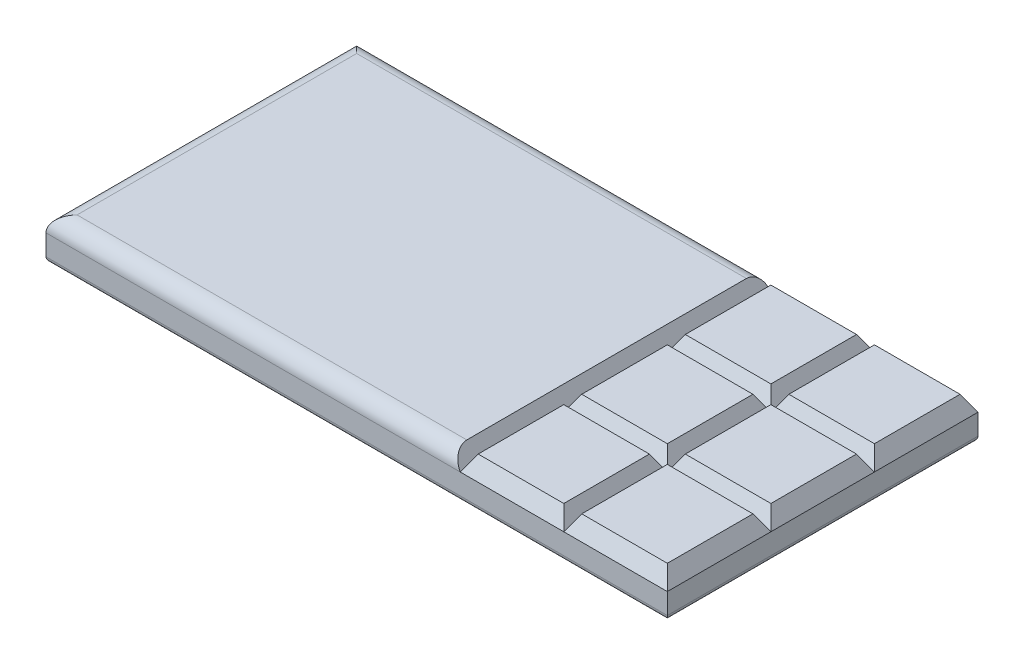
ISO-10303-21;
HEADER;
FILE_DESCRIPTION(('STEP AP214'),'2;1');
FILE_NAME('part.step','',(''),(''),'','','');
FILE_SCHEMA(('AUTOMOTIVE_DESIGN { 1 0 10303 214 1 1 1 1 }'));
ENDSEC;
DATA;
#1=APPLICATION_CONTEXT('core data for automotive mechanical design processes');
#2=APPLICATION_PROTOCOL_DEFINITION('international standard','automotive_design',2000,#1);
#3=PRODUCT_CONTEXT('',#1,'mechanical');
#4=PRODUCT('Part','Part','',(#3));
#5=PRODUCT_RELATED_PRODUCT_CATEGORY('part','',(#4));
#6=PRODUCT_DEFINITION_FORMATION('','',#4);
#7=PRODUCT_DEFINITION_CONTEXT('part definition',#1,'design');
#8=PRODUCT_DEFINITION('design','',#6,#7);
#9=PRODUCT_DEFINITION_SHAPE('','',#8);
#10=(LENGTH_UNIT() NAMED_UNIT(*) SI_UNIT(.MILLI.,.METRE.));
#11=(NAMED_UNIT(*) PLANE_ANGLE_UNIT() SI_UNIT($,.RADIAN.));
#12=(NAMED_UNIT(*) SI_UNIT($,.STERADIAN.) SOLID_ANGLE_UNIT());
#13=UNCERTAINTY_MEASURE_WITH_UNIT(LENGTH_MEASURE(1.E-05),#10,'distance_accuracy_value','');
#14=(GEOMETRIC_REPRESENTATION_CONTEXT(3) GLOBAL_UNCERTAINTY_ASSIGNED_CONTEXT((#13)) GLOBAL_UNIT_ASSIGNED_CONTEXT((#10,
#11,#12)) REPRESENTATION_CONTEXT('',''));
#15=CARTESIAN_POINT('',(0.,0.,0.));
#16=DIRECTION('',(0.,0.,1.));
#17=DIRECTION('',(1.,0.,0.));
#18=AXIS2_PLACEMENT_3D('',#15,#16,#17);
#19=CARTESIAN_POINT('',(0.,8.,0.));
#20=DIRECTION('',(0.,-1.,0.));
#21=DIRECTION('',(0.,0.,-1.));
#22=AXIS2_PLACEMENT_3D('',#19,#20,#21);
#23=PLANE('',#22);
#24=DIRECTION('',(0.,0.,-1.));
#25=VECTOR('',#24,1.);
#26=CARTESIAN_POINT('',(38.2679491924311,8.,0.));
#27=LINE('',#26,#25);
#28=CARTESIAN_POINT('',(38.2679491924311,8.,-11.7320508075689));
#29=VERTEX_POINT('',#28);
#30=CARTESIAN_POINT('',(38.2679491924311,8.,-28.2679491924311));
#31=VERTEX_POINT('',#30);
#32=EDGE_CURVE('E378',#29,#31,#27,.T.);
#33=ORIENTED_EDGE('',*,*,#32,.T.);
#34=DIRECTION('',(-1.,0.,0.));
#35=VECTOR('',#34,1.);
#36=CARTESIAN_POINT('',(0.,8.,-28.2679491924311));
#37=LINE('',#36,#35);
#38=CARTESIAN_POINT('',(21.732050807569,8.,-28.2679491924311));
#39=VERTEX_POINT('',#38);
#40=EDGE_CURVE('E491',#31,#39,#37,.T.);
#41=ORIENTED_EDGE('',*,*,#40,.T.);
#42=DIRECTION('',(0.,0.,1.));
#43=VECTOR('',#42,1.);
#44=CARTESIAN_POINT('',(21.7320508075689,8.,0.));
#45=LINE('',#44,#43);
#46=CARTESIAN_POINT('',(21.732050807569,8.,-11.7320508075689));
#47=VERTEX_POINT('',#46);
#48=EDGE_CURVE('E373',#39,#47,#45,.T.);
#49=ORIENTED_EDGE('',*,*,#48,.T.);
#50=DIRECTION('',(1.,0.,0.));
#51=VECTOR('',#50,1.);
#52=CARTESIAN_POINT('',(0.,8.,-11.7320508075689));
#53=LINE('',#52,#51);
#54=EDGE_CURVE('E478',#47,#29,#53,.T.);
#55=ORIENTED_EDGE('',*,*,#54,.T.);
#56=EDGE_LOOP('',(#33,#41,#49,#55));
#57=FACE_BOUND('',#56,.T.);
#58=ADVANCED_FACE('F35',(#57),#23,.F.);
#59=CARTESIAN_POINT('',(38.2679491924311,8.,8.26794919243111));
#60=VERTEX_POINT('',#59);
#61=CARTESIAN_POINT('',(38.2679491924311,8.,-8.26794919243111));
#62=VERTEX_POINT('',#61);
#63=EDGE_CURVE('E381',#60,#62,#27,.T.);
#64=ORIENTED_EDGE('',*,*,#63,.T.);
#65=DIRECTION('',(-1.,0.,0.));
#66=VECTOR('',#65,1.);
#67=CARTESIAN_POINT('',(0.,8.,-8.26794919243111));
#68=LINE('',#67,#66);
#69=CARTESIAN_POINT('',(21.732050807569,8.,-8.26794919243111));
#70=VERTEX_POINT('',#69);
#71=EDGE_CURVE('E469',#62,#70,#68,.T.);
#72=ORIENTED_EDGE('',*,*,#71,.T.);
#73=CARTESIAN_POINT('',(21.732050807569,8.,8.26794919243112));
#74=VERTEX_POINT('',#73);
#75=EDGE_CURVE('E376',#70,#74,#45,.T.);
#76=ORIENTED_EDGE('',*,*,#75,.T.);
#77=DIRECTION('',(1.,0.,0.));
#78=VECTOR('',#77,1.);
#79=CARTESIAN_POINT('',(0.,8.,8.26794919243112));
#80=LINE('',#79,#78);
#81=EDGE_CURVE('E418',#74,#60,#80,.T.);
#82=ORIENTED_EDGE('',*,*,#81,.T.);
#83=EDGE_LOOP('',(#64,#72,#76,#82));
#84=FACE_BOUND('',#83,.T.);
#85=ADVANCED_FACE('F527',(#84),#23,.F.);
#86=DIRECTION('',(0.,0.,-1.));
#87=VECTOR('',#86,1.);
#88=CARTESIAN_POINT('',(58.2679491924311,8.,0.));
#89=LINE('',#88,#87);
#90=CARTESIAN_POINT('',(58.2679491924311,8.,-11.7320508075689));
#91=VERTEX_POINT('',#90);
#92=CARTESIAN_POINT('',(58.2679491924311,8.,-28.2679491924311));
#93=VERTEX_POINT('',#92);
#94=EDGE_CURVE('E235',#91,#93,#89,.T.);
#95=ORIENTED_EDGE('',*,*,#94,.T.);
#96=DIRECTION('',(-1.,0.,0.));
#97=VECTOR('',#96,1.);
#98=CARTESIAN_POINT('',(0.,8.,-28.2679491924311));
#99=LINE('',#98,#97);
#100=CARTESIAN_POINT('',(41.7320508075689,8.,-28.2679491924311));
#101=VERTEX_POINT('',#100);
#102=EDGE_CURVE('E483',#93,#101,#99,.T.);
#103=ORIENTED_EDGE('',*,*,#102,.T.);
#104=DIRECTION('',(0.,0.,1.));
#105=VECTOR('',#104,1.);
#106=CARTESIAN_POINT('',(41.7320508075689,8.,0.));
#107=LINE('',#106,#105);
#108=CARTESIAN_POINT('',(41.7320508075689,8.,-11.7320508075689));
#109=VERTEX_POINT('',#108);
#110=EDGE_CURVE('E382',#101,#109,#107,.T.);
#111=ORIENTED_EDGE('',*,*,#110,.T.);
#112=DIRECTION('',(1.,0.,0.));
#113=VECTOR('',#112,1.);
#114=CARTESIAN_POINT('',(0.,8.,-11.7320508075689));
#115=LINE('',#114,#113);
#116=EDGE_CURVE('E473',#109,#91,#115,.T.);
#117=ORIENTED_EDGE('',*,*,#116,.T.);
#118=EDGE_LOOP('',(#95,#103,#111,#117));
#119=FACE_BOUND('',#118,.T.);
#120=ADVANCED_FACE('F533',(#119),#23,.F.);
#121=CARTESIAN_POINT('',(58.2679491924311,8.,8.26794919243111));
#122=VERTEX_POINT('',#121);
#123=CARTESIAN_POINT('',(58.2679491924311,8.,-8.26794919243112));
#124=VERTEX_POINT('',#123);
#125=EDGE_CURVE('E371',#122,#124,#89,.T.);
#126=ORIENTED_EDGE('',*,*,#125,.T.);
#127=DIRECTION('',(-1.,0.,0.));
#128=VECTOR('',#127,1.);
#129=CARTESIAN_POINT('',(0.,8.,-8.26794919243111));
#130=LINE('',#129,#128);
#131=CARTESIAN_POINT('',(41.7320508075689,8.,-8.26794919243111));
#132=VERTEX_POINT('',#131);
#133=EDGE_CURVE('E208',#124,#132,#130,.T.);
#134=ORIENTED_EDGE('',*,*,#133,.T.);
#135=CARTESIAN_POINT('',(41.7320508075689,8.,8.26794919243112));
#136=VERTEX_POINT('',#135);
#137=EDGE_CURVE('E386',#132,#136,#107,.T.);
#138=ORIENTED_EDGE('',*,*,#137,.T.);
#139=DIRECTION('',(1.,0.,0.));
#140=VECTOR('',#139,1.);
#141=CARTESIAN_POINT('',(0.,8.,8.26794919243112));
#142=LINE('',#141,#140);
#143=EDGE_CURVE('E459',#136,#122,#142,.T.);
#144=ORIENTED_EDGE('',*,*,#143,.T.);
#145=EDGE_LOOP('',(#126,#134,#138,#144));
#146=FACE_BOUND('',#145,.T.);
#147=ADVANCED_FACE('F555',(#146),#23,.F.);
#148=CARTESIAN_POINT('',(37.4019237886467,9.49999999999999,-30.));
#149=DIRECTION('',(-0.866025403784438,-0.5,0.));
#150=DIRECTION('',(0.5,-0.866025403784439,0.));
#151=AXIS2_PLACEMENT_3D('',#148,#149,#150);
#152=PLANE('',#151);
#153=DIRECTION('',(0.,0.,1.));
#154=VECTOR('',#153,1.);
#155=CARTESIAN_POINT('',(40.,5.00000000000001,-30.));
#156=LINE('',#155,#154);
#157=CARTESIAN_POINT('',(40.,4.99999999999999,-30.));
#158=VERTEX_POINT('',#157);
#159=CARTESIAN_POINT('',(40.,4.99999999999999,-9.99999999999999));
#160=VERTEX_POINT('',#159);
#161=EDGE_CURVE('E278',#158,#160,#156,.T.);
#162=ORIENTED_EDGE('',*,*,#161,.F.);
#163=DIRECTION('',(-0.447213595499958,0.774596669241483,0.447213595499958));
#164=VECTOR('',#163,1.);
#165=CARTESIAN_POINT('',(37.9215390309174,8.59999999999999,-27.9215390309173));
#166=LINE('',#165,#164);
#167=EDGE_CURVE('E488',#158,#31,#166,.T.);
#168=ORIENTED_EDGE('',*,*,#167,.T.);
#169=ORIENTED_EDGE('',*,*,#32,.F.);
#170=DIRECTION('',(0.447213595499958,-0.774596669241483,0.447213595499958));
#171=VECTOR('',#170,1.);
#172=CARTESIAN_POINT('',(33.9215390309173,15.5282032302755,-16.0784609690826));
#173=LINE('',#172,#171);
#174=EDGE_CURVE('E476',#29,#160,#173,.T.);
#175=ORIENTED_EDGE('',*,*,#174,.T.);
#176=EDGE_LOOP('',(#162,#168,#169,#175));
#177=FACE_BOUND('',#176,.T.);
#178=ADVANCED_FACE('F576',(#177),#152,.F.);
#179=CARTESIAN_POINT('',(40.,4.99999999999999,10.));
#180=VERTEX_POINT('',#179);
#181=EDGE_CURVE('E277',#160,#180,#156,.T.);
#182=ORIENTED_EDGE('',*,*,#181,.F.);
#183=DIRECTION('',(-0.447213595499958,0.774596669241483,0.447213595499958));
#184=VECTOR('',#183,1.);
#185=CARTESIAN_POINT('',(41.9215390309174,1.67179676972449,-11.9215390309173));
#186=LINE('',#185,#184);
#187=EDGE_CURVE('E467',#160,#62,#186,.T.);
#188=ORIENTED_EDGE('',*,*,#187,.T.);
#189=ORIENTED_EDGE('',*,*,#63,.F.);
#190=DIRECTION('',(0.447213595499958,-0.774596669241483,0.447213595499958));
#191=VECTOR('',#190,1.);
#192=CARTESIAN_POINT('',(29.9215390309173,22.456406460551,-0.0784609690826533));
#193=LINE('',#192,#191);
#194=EDGE_CURVE('E412',#60,#180,#193,.T.);
#195=ORIENTED_EDGE('',*,*,#194,.T.);
#196=EDGE_LOOP('',(#182,#188,#189,#195));
#197=FACE_BOUND('',#196,.T.);
#198=ADVANCED_FACE('F414',(#197),#152,.F.);
#199=CARTESIAN_POINT('',(40.,5.00000000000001,-30.));
#200=DIRECTION('',(0.866025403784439,-0.5,0.));
#201=DIRECTION('',(0.5,0.866025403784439,0.));
#202=AXIS2_PLACEMENT_3D('',#199,#200,#201);
#203=PLANE('',#202);
#204=ORIENTED_EDGE('',*,*,#110,.F.);
#205=DIRECTION('',(-0.447213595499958,-0.774596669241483,-0.447213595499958));
#206=VECTOR('',#205,1.);
#207=CARTESIAN_POINT('',(40.,5.00000000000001,-30.));
#208=LINE('',#207,#206);
#209=EDGE_CURVE('E486',#101,#158,#208,.T.);
#210=ORIENTED_EDGE('',*,*,#209,.T.);
#211=ORIENTED_EDGE('',*,*,#161,.T.);
#212=DIRECTION('',(0.447213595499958,0.774596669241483,-0.447213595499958));
#213=VECTOR('',#212,1.);
#214=CARTESIAN_POINT('',(44.,11.9282032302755,-14.));
#215=LINE('',#214,#213);
#216=EDGE_CURVE('E222',#160,#109,#215,.T.);
#217=ORIENTED_EDGE('',*,*,#216,.T.);
#218=EDGE_LOOP('',(#204,#210,#211,#217));
#219=FACE_BOUND('',#218,.T.);
#220=ADVANCED_FACE('F573',(#219),#203,.F.);
#221=ORIENTED_EDGE('',*,*,#137,.F.);
#222=DIRECTION('',(-0.447213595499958,-0.774596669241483,-0.447213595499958));
#223=VECTOR('',#222,1.);
#224=CARTESIAN_POINT('',(36.,-1.9282032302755,-14.));
#225=LINE('',#224,#223);
#226=EDGE_CURVE('E408',#132,#160,#225,.T.);
#227=ORIENTED_EDGE('',*,*,#226,.T.);
#228=ORIENTED_EDGE('',*,*,#181,.T.);
#229=DIRECTION('',(0.447213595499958,0.774596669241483,-0.447213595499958));
#230=VECTOR('',#229,1.);
#231=CARTESIAN_POINT('',(48.,18.856406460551,1.99999999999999));
#232=LINE('',#231,#230);
#233=EDGE_CURVE('E406',#180,#136,#232,.T.);
#234=ORIENTED_EDGE('',*,*,#233,.T.);
#235=EDGE_LOOP('',(#221,#227,#228,#234));
#236=FACE_BOUND('',#235,.T.);
#237=ADVANCED_FACE('F404',(#236),#203,.F.);
#238=CARTESIAN_POINT('',(20.,4.99999999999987,-30.));
#239=DIRECTION('',(0.866025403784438,-0.5,0.));
#240=DIRECTION('',(0.5,0.866025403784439,0.));
#241=AXIS2_PLACEMENT_3D('',#238,#239,#240);
#242=PLANE('',#241);
#243=ORIENTED_EDGE('',*,*,#48,.F.);
#244=DIRECTION('',(-0.447213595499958,-0.774596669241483,-0.447213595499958));
#245=VECTOR('',#244,1.);
#246=CARTESIAN_POINT('',(20.,4.99999999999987,-30.));
#247=LINE('',#246,#245);
#248=CARTESIAN_POINT('',(19.9999999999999,4.99999999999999,-30.));
#249=VERTEX_POINT('',#248);
#250=EDGE_CURVE('E494',#39,#249,#247,.T.);
#251=ORIENTED_EDGE('',*,*,#250,.T.);
#252=DIRECTION('',(0.,0.,1.));
#253=VECTOR('',#252,1.);
#254=CARTESIAN_POINT('',(20.,4.99999999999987,-30.));
#255=LINE('',#254,#253);
#256=CARTESIAN_POINT('',(19.9999999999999,4.99999999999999,-9.99999999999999));
#257=VERTEX_POINT('',#256);
#258=EDGE_CURVE('E255',#249,#257,#255,.T.);
#259=ORIENTED_EDGE('',*,*,#258,.T.);
#260=DIRECTION('',(0.447213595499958,0.774596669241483,-0.447213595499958));
#261=VECTOR('',#260,1.);
#262=CARTESIAN_POINT('',(24.,11.9282032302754,-13.9999999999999));
#263=LINE('',#262,#261);
#264=EDGE_CURVE('E481',#257,#47,#263,.T.);
#265=ORIENTED_EDGE('',*,*,#264,.T.);
#266=EDGE_LOOP('',(#243,#251,#259,#265));
#267=FACE_BOUND('',#266,.T.);
#268=ADVANCED_FACE('F561',(#267),#242,.F.);
#269=ORIENTED_EDGE('',*,*,#75,.F.);
#270=DIRECTION('',(-0.447213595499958,-0.774596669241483,-0.447213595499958));
#271=VECTOR('',#270,1.);
#272=CARTESIAN_POINT('',(16.,-1.92820323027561,-14.));
#273=LINE('',#272,#271);
#274=EDGE_CURVE('E288',#70,#257,#273,.T.);
#275=ORIENTED_EDGE('',*,*,#274,.T.);
#276=CARTESIAN_POINT('',(19.9999999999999,4.99999999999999,10.));
#277=VERTEX_POINT('',#276);
#278=EDGE_CURVE('E253',#257,#277,#255,.T.);
#279=ORIENTED_EDGE('',*,*,#278,.T.);
#280=DIRECTION('',(0.447213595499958,0.774596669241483,-0.447213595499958));
#281=VECTOR('',#280,1.);
#282=CARTESIAN_POINT('',(28.,18.8564064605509,2.00000000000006));
#283=LINE('',#282,#281);
#284=EDGE_CURVE('E286',#277,#74,#283,.T.);
#285=ORIENTED_EDGE('',*,*,#284,.T.);
#286=EDGE_LOOP('',(#269,#275,#279,#285));
#287=FACE_BOUND('',#286,.T.);
#288=ADVANCED_FACE('F285',(#287),#242,.F.);
#289=CARTESIAN_POINT('',(57.4019237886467,9.49999999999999,-30.));
#290=DIRECTION('',(-0.866025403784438,-0.5,0.));
#291=DIRECTION('',(0.5,-0.866025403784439,0.));
#292=AXIS2_PLACEMENT_3D('',#289,#290,#291);
#293=PLANE('',#292);
#294=DIRECTION('',(0.,0.,1.));
#295=VECTOR('',#294,1.);
#296=CARTESIAN_POINT('',(60.,5.00000000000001,-30.));
#297=LINE('',#296,#295);
#298=CARTESIAN_POINT('',(60.,4.99999999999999,-30.));
#299=VERTEX_POINT('',#298);
#300=CARTESIAN_POINT('',(60.,4.99999999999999,-9.99999999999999));
#301=VERTEX_POINT('',#300);
#302=EDGE_CURVE('E232',#299,#301,#297,.T.);
#303=ORIENTED_EDGE('',*,*,#302,.F.);
#304=DIRECTION('',(-0.447213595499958,0.774596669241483,0.447213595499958));
#305=VECTOR('',#304,1.);
#306=CARTESIAN_POINT('',(57.9215390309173,8.59999999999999,-27.9215390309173));
#307=LINE('',#306,#305);
#308=EDGE_CURVE('E236',#299,#93,#307,.T.);
#309=ORIENTED_EDGE('',*,*,#308,.T.);
#310=ORIENTED_EDGE('',*,*,#94,.F.);
#311=DIRECTION('',(0.447213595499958,-0.774596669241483,0.447213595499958));
#312=VECTOR('',#311,1.);
#313=CARTESIAN_POINT('',(53.9215390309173,15.5282032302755,-16.0784609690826));
#314=LINE('',#313,#312);
#315=EDGE_CURVE('E213',#91,#301,#314,.T.);
#316=ORIENTED_EDGE('',*,*,#315,.T.);
#317=EDGE_LOOP('',(#303,#309,#310,#316));
#318=FACE_BOUND('',#317,.T.);
#319=ADVANCED_FACE('F229',(#318),#293,.F.);
#320=CARTESIAN_POINT('',(60.,4.99999999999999,10.));
#321=VERTEX_POINT('',#320);
#322=EDGE_CURVE('E240',#301,#321,#297,.T.);
#323=ORIENTED_EDGE('',*,*,#322,.F.);
#324=DIRECTION('',(-0.447213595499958,0.774596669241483,0.447213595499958));
#325=VECTOR('',#324,1.);
#326=CARTESIAN_POINT('',(61.9215390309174,1.67179676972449,-11.9215390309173));
#327=LINE('',#326,#325);
#328=EDGE_CURVE('E202',#301,#124,#327,.T.);
#329=ORIENTED_EDGE('',*,*,#328,.T.);
#330=ORIENTED_EDGE('',*,*,#125,.F.);
#331=DIRECTION('',(0.447213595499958,-0.774596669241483,0.447213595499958));
#332=VECTOR('',#331,1.);
#333=CARTESIAN_POINT('',(49.9215390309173,22.456406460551,-0.0784609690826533));
#334=LINE('',#333,#332);
#335=EDGE_CURVE('E214',#122,#321,#334,.T.);
#336=ORIENTED_EDGE('',*,*,#335,.T.);
#337=EDGE_LOOP('',(#323,#329,#330,#336));
#338=FACE_BOUND('',#337,.T.);
#339=ADVANCED_FACE('F241',(#338),#293,.F.);
#340=DIRECTION('',(0.,0.,-1.));
#341=VECTOR('',#340,1.);
#342=CARTESIAN_POINT('',(18.267949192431,8.,0.));
#343=LINE('',#342,#341);
#344=CARTESIAN_POINT('',(18.267949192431,8.,27.));
#345=VERTEX_POINT('',#344);
#346=CARTESIAN_POINT('',(18.267949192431,8.,-27.));
#347=VERTEX_POINT('',#346);
#348=EDGE_CURVE('E326',#345,#347,#343,.T.);
#349=ORIENTED_EDGE('',*,*,#348,.T.);
#350=DIRECTION('',(-1.,0.,0.));
#351=VECTOR('',#350,1.);
#352=CARTESIAN_POINT('',(0.,8.,-27.));
#353=LINE('',#352,#351);
#354=CARTESIAN_POINT('',(-57.,8.,-27.));
#355=VERTEX_POINT('',#354);
#356=EDGE_CURVE('E319',#347,#355,#353,.T.);
#357=ORIENTED_EDGE('',*,*,#356,.T.);
#358=DIRECTION('',(0.,0.,1.));
#359=VECTOR('',#358,1.);
#360=CARTESIAN_POINT('',(-57.,8.,0.));
#361=LINE('',#360,#359);
#362=CARTESIAN_POINT('',(-57.,8.,27.));
#363=VERTEX_POINT('',#362);
#364=EDGE_CURVE('E321',#355,#363,#361,.T.);
#365=ORIENTED_EDGE('',*,*,#364,.T.);
#366=DIRECTION('',(1.,0.,0.));
#367=VECTOR('',#366,1.);
#368=CARTESIAN_POINT('',(0.,8.,27.));
#369=LINE('',#368,#367);
#370=EDGE_CURVE('E303',#363,#345,#369,.T.);
#371=ORIENTED_EDGE('',*,*,#370,.T.);
#372=EDGE_LOOP('',(#349,#357,#365,#371));
#373=FACE_BOUND('',#372,.T.);
#374=ADVANCED_FACE('F325',(#373),#23,.F.);
#375=CARTESIAN_POINT('',(21.732050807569,8.,11.7320508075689));
#376=VERTEX_POINT('',#375);
#377=CARTESIAN_POINT('',(21.732050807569,8.,28.267949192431));
#378=VERTEX_POINT('',#377);
#379=EDGE_CURVE('E374',#376,#378,#45,.T.);
#380=ORIENTED_EDGE('',*,*,#379,.T.);
#381=DIRECTION('',(1.,0.,0.));
#382=VECTOR('',#381,1.);
#383=CARTESIAN_POINT('',(0.,8.,28.267949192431));
#384=LINE('',#383,#382);
#385=CARTESIAN_POINT('',(38.2679491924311,8.,28.267949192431));
#386=VERTEX_POINT('',#385);
#387=EDGE_CURVE('E260',#378,#386,#384,.T.);
#388=ORIENTED_EDGE('',*,*,#387,.T.);
#389=CARTESIAN_POINT('',(38.2679491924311,8.,11.7320508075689));
#390=VERTEX_POINT('',#389);
#391=EDGE_CURVE('E377',#386,#390,#27,.T.);
#392=ORIENTED_EDGE('',*,*,#391,.T.);
#393=DIRECTION('',(-1.,0.,0.));
#394=VECTOR('',#393,1.);
#395=CARTESIAN_POINT('',(0.,8.,11.7320508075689));
#396=LINE('',#395,#394);
#397=EDGE_CURVE('E455',#390,#376,#396,.T.);
#398=ORIENTED_EDGE('',*,*,#397,.T.);
#399=EDGE_LOOP('',(#380,#388,#392,#398));
#400=FACE_BOUND('',#399,.T.);
#401=ADVANCED_FACE('F539',(#400),#23,.F.);
#402=CARTESIAN_POINT('',(60.,8.,30.));
#403=DIRECTION('',(-1.,0.,0.));
#404=DIRECTION('',(0.,0.,1.));
#405=AXIS2_PLACEMENT_3D('',#402,#403,#404);
#406=PLANE('',#405);
#407=DIRECTION('',(0.,-1.,0.));
#408=VECTOR('',#407,1.);
#409=CARTESIAN_POINT('',(60.,8.,30.));
#410=LINE('',#409,#408);
#411=CARTESIAN_POINT('',(60.,5.00000000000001,30.));
#412=VERTEX_POINT('',#411);
#413=CARTESIAN_POINT('',(60.,1.,30.));
#414=VERTEX_POINT('',#413);
#415=EDGE_CURVE('E392',#412,#414,#410,.T.);
#416=ORIENTED_EDGE('',*,*,#415,.T.);
#417=DIRECTION('',(0.,0.,-1.));
#418=VECTOR('',#417,1.);
#419=CARTESIAN_POINT('',(60.,1.,-30.));
#420=LINE('',#419,#418);
#421=CARTESIAN_POINT('',(60.,1.,-30.));
#422=VERTEX_POINT('',#421);
#423=EDGE_CURVE('E331',#414,#422,#420,.T.);
#424=ORIENTED_EDGE('',*,*,#423,.T.);
#425=DIRECTION('',(0.,-1.,0.));
#426=VECTOR('',#425,1.);
#427=CARTESIAN_POINT('',(60.,8.,-30.));
#428=LINE('',#427,#426);
#429=EDGE_CURVE('E250',#299,#422,#428,.T.);
#430=ORIENTED_EDGE('',*,*,#429,.F.);
#431=ORIENTED_EDGE('',*,*,#302,.T.);
#432=ORIENTED_EDGE('',*,*,#322,.T.);
#433=EDGE_CURVE('E245',#321,#412,#297,.T.);
#434=ORIENTED_EDGE('',*,*,#433,.T.);
#435=EDGE_LOOP('',(#416,#424,#430,#431,#432,#434));
#436=FACE_BOUND('',#435,.T.);
#437=ADVANCED_FACE('F248',(#436),#406,.F.);
#438=CARTESIAN_POINT('',(-60.,8.,-30.));
#439=DIRECTION('',(0.,0.,1.));
#440=DIRECTION('',(1.,0.,0.));
#441=AXIS2_PLACEMENT_3D('',#438,#439,#440);
#442=PLANE('',#441);
#443=DIRECTION('',(0.,-1.,0.));
#444=VECTOR('',#443,1.);
#445=CARTESIAN_POINT('',(-60.,8.,-30.));
#446=LINE('',#445,#444);
#447=CARTESIAN_POINT('',(-60.,5.,-30.));
#448=VERTEX_POINT('',#447);
#449=CARTESIAN_POINT('',(-60.,1.,-30.));
#450=VERTEX_POINT('',#449);
#451=EDGE_CURVE('E388',#448,#450,#446,.T.);
#452=ORIENTED_EDGE('',*,*,#451,.F.);
#453=DIRECTION('',(-1.,0.,0.));
#454=VECTOR('',#453,1.);
#455=CARTESIAN_POINT('',(-60.,5.,-30.));
#456=LINE('',#455,#454);
#457=EDGE_CURVE('E320',#448,#249,#456,.F.);
#458=ORIENTED_EDGE('',*,*,#457,.T.);
#459=DIRECTION('',(1.,0.,0.));
#460=VECTOR('',#459,1.);
#461=CARTESIAN_POINT('',(11.2954031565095,4.99999999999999,-30.));
#462=LINE('',#461,#460);
#463=EDGE_CURVE('E224',#249,#158,#462,.T.);
#464=ORIENTED_EDGE('',*,*,#463,.T.);
#465=EDGE_CURVE('E447',#158,#299,#462,.T.);
#466=ORIENTED_EDGE('',*,*,#465,.T.);
#467=ORIENTED_EDGE('',*,*,#429,.T.);
#468=DIRECTION('',(-1.,0.,0.));
#469=VECTOR('',#468,1.);
#470=CARTESIAN_POINT('',(-60.,1.,-30.));
#471=LINE('',#470,#469);
#472=EDGE_CURVE('E358',#422,#450,#471,.T.);
#473=ORIENTED_EDGE('',*,*,#472,.T.);
#474=EDGE_LOOP('',(#452,#458,#464,#466,#467,#473));
#475=FACE_BOUND('',#474,.T.);
#476=ADVANCED_FACE('F553',(#475),#442,.F.);
#477=CARTESIAN_POINT('',(-60.,8.,30.));
#478=DIRECTION('',(1.,0.,0.));
#479=DIRECTION('',(0.,0.,-1.));
#480=AXIS2_PLACEMENT_3D('',#477,#478,#479);
#481=PLANE('',#480);
#482=DIRECTION('',(0.,-1.,0.));
#483=VECTOR('',#482,1.);
#484=CARTESIAN_POINT('',(-60.,8.,30.));
#485=LINE('',#484,#483);
#486=CARTESIAN_POINT('',(-60.,5.,30.));
#487=VERTEX_POINT('',#486);
#488=CARTESIAN_POINT('',(-60.,1.,30.));
#489=VERTEX_POINT('',#488);
#490=EDGE_CURVE('E390',#487,#489,#485,.T.);
#491=ORIENTED_EDGE('',*,*,#490,.F.);
#492=DIRECTION('',(0.,0.,1.));
#493=VECTOR('',#492,1.);
#494=CARTESIAN_POINT('',(-60.,5.,30.));
#495=LINE('',#494,#493);
#496=EDGE_CURVE('E44',#487,#448,#495,.F.);
#497=ORIENTED_EDGE('',*,*,#496,.T.);
#498=ORIENTED_EDGE('',*,*,#451,.T.);
#499=DIRECTION('',(0.,0.,1.));
#500=VECTOR('',#499,1.);
#501=CARTESIAN_POINT('',(-60.,1.,30.));
#502=LINE('',#501,#500);
#503=EDGE_CURVE('E346',#450,#489,#502,.T.);
#504=ORIENTED_EDGE('',*,*,#503,.T.);
#505=EDGE_LOOP('',(#491,#497,#498,#504));
#506=FACE_BOUND('',#505,.T.);
#507=ADVANCED_FACE('F545',(#506),#481,.F.);
#508=CARTESIAN_POINT('',(-60.,8.,30.));
#509=DIRECTION('',(0.,0.,-1.));
#510=DIRECTION('',(-1.,0.,0.));
#511=AXIS2_PLACEMENT_3D('',#508,#509,#510);
#512=PLANE('',#511);
#513=DIRECTION('',(1.,0.,0.));
#514=VECTOR('',#513,1.);
#515=CARTESIAN_POINT('',(11.2954031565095,4.99999999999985,30.));
#516=LINE('',#515,#514);
#517=CARTESIAN_POINT('',(20.,4.99999999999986,30.));
#518=VERTEX_POINT('',#517);
#519=CARTESIAN_POINT('',(39.9999999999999,4.99999999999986,30.));
#520=VERTEX_POINT('',#519);
#521=EDGE_CURVE('E443',#518,#520,#516,.T.);
#522=ORIENTED_EDGE('',*,*,#521,.F.);
#523=DIRECTION('',(1.,0.,0.));
#524=VECTOR('',#523,1.);
#525=CARTESIAN_POINT('',(-60.,5.,30.));
#526=LINE('',#525,#524);
#527=EDGE_CURVE('E12',#518,#487,#526,.F.);
#528=ORIENTED_EDGE('',*,*,#527,.T.);
#529=ORIENTED_EDGE('',*,*,#490,.T.);
#530=DIRECTION('',(1.,0.,0.));
#531=VECTOR('',#530,1.);
#532=CARTESIAN_POINT('',(60.,1.,30.));
#533=LINE('',#532,#531);
#534=EDGE_CURVE('E344',#489,#414,#533,.T.);
#535=ORIENTED_EDGE('',*,*,#534,.T.);
#536=ORIENTED_EDGE('',*,*,#415,.F.);
#537=EDGE_CURVE('E335',#520,#412,#516,.T.);
#538=ORIENTED_EDGE('',*,*,#537,.F.);
#539=EDGE_LOOP('',(#522,#528,#529,#535,#536,#538));
#540=FACE_BOUND('',#539,.T.);
#541=ADVANCED_FACE('F442',(#540),#512,.F.);
#542=CARTESIAN_POINT('',(41.7320508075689,8.,11.7320508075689));
#543=VERTEX_POINT('',#542);
#544=CARTESIAN_POINT('',(41.7320508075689,8.,28.267949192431));
#545=VERTEX_POINT('',#544);
#546=EDGE_CURVE('E383',#543,#545,#107,.T.);
#547=ORIENTED_EDGE('',*,*,#546,.T.);
#548=DIRECTION('',(1.,0.,0.));
#549=VECTOR('',#548,1.);
#550=CARTESIAN_POINT('',(0.,8.,28.267949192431));
#551=LINE('',#550,#549);
#552=CARTESIAN_POINT('',(58.2679491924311,8.,28.267949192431));
#553=VERTEX_POINT('',#552);
#554=EDGE_CURVE('E496',#545,#553,#551,.T.);
#555=ORIENTED_EDGE('',*,*,#554,.T.);
#556=CARTESIAN_POINT('',(58.2679491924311,8.,11.7320508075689));
#557=VERTEX_POINT('',#556);
#558=EDGE_CURVE('E369',#553,#557,#89,.T.);
#559=ORIENTED_EDGE('',*,*,#558,.T.);
#560=DIRECTION('',(-1.,0.,0.));
#561=VECTOR('',#560,1.);
#562=CARTESIAN_POINT('',(0.,8.,11.7320508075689));
#563=LINE('',#562,#561);
#564=EDGE_CURVE('E431',#557,#543,#563,.T.);
#565=ORIENTED_EDGE('',*,*,#564,.T.);
#566=EDGE_LOOP('',(#547,#555,#559,#565));
#567=FACE_BOUND('',#566,.T.);
#568=ADVANCED_FACE('F500',(#567),#23,.F.);
#569=CARTESIAN_POINT('',(0.,0.,0.));
#570=DIRECTION('',(0.,-1.,0.));
#571=DIRECTION('',(0.,0.,-1.));
#572=AXIS2_PLACEMENT_3D('',#569,#570,#571);
#573=PLANE('',#572);
#574=DIRECTION('',(0.,0.,1.));
#575=VECTOR('',#574,1.);
#576=CARTESIAN_POINT('',(-59.,0.,-30.));
#577=LINE('',#576,#575);
#578=CARTESIAN_POINT('',(-59.,0.,29.));
#579=VERTEX_POINT('',#578);
#580=CARTESIAN_POINT('',(-59.,0.,-29.));
#581=VERTEX_POINT('',#580);
#582=EDGE_CURVE('E352',#579,#581,#577,.F.);
#583=ORIENTED_EDGE('',*,*,#582,.T.);
#584=DIRECTION('',(-1.,0.,0.));
#585=VECTOR('',#584,1.);
#586=CARTESIAN_POINT('',(60.,0.,-29.));
#587=LINE('',#586,#585);
#588=CARTESIAN_POINT('',(59.,0.,-29.));
#589=VERTEX_POINT('',#588);
#590=EDGE_CURVE('E349',#581,#589,#587,.F.);
#591=ORIENTED_EDGE('',*,*,#590,.T.);
#592=DIRECTION('',(0.,0.,-1.));
#593=VECTOR('',#592,1.);
#594=CARTESIAN_POINT('',(59.,0.,30.));
#595=LINE('',#594,#593);
#596=CARTESIAN_POINT('',(59.,0.,29.));
#597=VERTEX_POINT('',#596);
#598=EDGE_CURVE('E356',#589,#597,#595,.F.);
#599=ORIENTED_EDGE('',*,*,#598,.T.);
#600=DIRECTION('',(1.,0.,0.));
#601=VECTOR('',#600,1.);
#602=CARTESIAN_POINT('',(-60.,0.,29.));
#603=LINE('',#602,#601);
#604=EDGE_CURVE('E354',#597,#579,#603,.F.);
#605=ORIENTED_EDGE('',*,*,#604,.T.);
#606=EDGE_LOOP('',(#583,#591,#599,#605));
#607=FACE_BOUND('',#606,.T.);
#608=ADVANCED_FACE('F538',(#607),#573,.T.);
#609=ORIENTED_EDGE('',*,*,#391,.F.);
#610=DIRECTION('',(0.447213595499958,-0.774596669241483,0.447213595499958));
#611=VECTOR('',#610,1.);
#612=CARTESIAN_POINT('',(25.9215390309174,29.3846096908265,15.9215390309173));
#613=LINE('',#612,#611);
#614=EDGE_CURVE('E267',#386,#520,#613,.T.);
#615=ORIENTED_EDGE('',*,*,#614,.T.);
#616=EDGE_CURVE('E271',#180,#520,#156,.T.);
#617=ORIENTED_EDGE('',*,*,#616,.F.);
#618=DIRECTION('',(-0.447213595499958,0.774596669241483,0.447213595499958));
#619=VECTOR('',#618,1.);
#620=CARTESIAN_POINT('',(45.9215390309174,-5.25640646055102,4.07846096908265));
#621=LINE('',#620,#619);
#622=EDGE_CURVE('E430',#180,#390,#621,.T.);
#623=ORIENTED_EDGE('',*,*,#622,.T.);
#624=EDGE_LOOP('',(#609,#615,#617,#623));
#625=FACE_BOUND('',#624,.T.);
#626=ADVANCED_FACE('F436',(#625),#152,.F.);
#627=ORIENTED_EDGE('',*,*,#616,.T.);
#628=DIRECTION('',(0.447213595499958,0.774596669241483,-0.447213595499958));
#629=VECTOR('',#628,1.);
#630=CARTESIAN_POINT('',(52.,25.7846096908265,17.9999999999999));
#631=LINE('',#630,#629);
#632=EDGE_CURVE('E441',#520,#545,#631,.T.);
#633=ORIENTED_EDGE('',*,*,#632,.T.);
#634=ORIENTED_EDGE('',*,*,#546,.F.);
#635=DIRECTION('',(-0.447213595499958,-0.774596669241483,-0.447213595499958));
#636=VECTOR('',#635,1.);
#637=CARTESIAN_POINT('',(32.,-8.85640646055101,2.00000000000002));
#638=LINE('',#637,#636);
#639=EDGE_CURVE('E422',#543,#180,#638,.T.);
#640=ORIENTED_EDGE('',*,*,#639,.T.);
#641=EDGE_LOOP('',(#627,#633,#634,#640));
#642=FACE_BOUND('',#641,.T.);
#643=ADVANCED_FACE('F424',(#642),#203,.F.);
#644=CARTESIAN_POINT('',(17.4019237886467,9.49999999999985,-30.));
#645=DIRECTION('',(-0.866025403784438,-0.5,0.));
#646=DIRECTION('',(0.5,-0.866025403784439,0.));
#647=AXIS2_PLACEMENT_3D('',#644,#645,#646);
#648=PLANE('',#647);
#649=ORIENTED_EDGE('',*,*,#258,.F.);
#650=CARTESIAN_POINT('',(19.9999999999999,5.,-27.));
#651=DIRECTION('',(-0.866025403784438,-0.5,0.));
#652=DIRECTION('',(-0.5,0.866025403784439,0.));
#653=AXIS2_PLACEMENT_3D('',#650,#651,#652);
#654=ELLIPSE('',#653,3.46410161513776,3.);
#655=EDGE_CURVE('E310',#249,#347,#654,.F.);
#656=ORIENTED_EDGE('',*,*,#655,.T.);
#657=ORIENTED_EDGE('',*,*,#348,.F.);
#658=CARTESIAN_POINT('',(19.9999999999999,5.,27.));
#659=DIRECTION('',(-0.866025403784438,-0.5,0.));
#660=DIRECTION('',(0.5,-0.866025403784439,0.));
#661=AXIS2_PLACEMENT_3D('',#658,#659,#660);
#662=ELLIPSE('',#661,3.46410161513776,3.);
#663=EDGE_CURVE('E295',#345,#518,#662,.F.);
#664=ORIENTED_EDGE('',*,*,#663,.T.);
#665=EDGE_CURVE('E251',#277,#518,#255,.T.);
#666=ORIENTED_EDGE('',*,*,#665,.F.);
#667=ORIENTED_EDGE('',*,*,#278,.F.);
#668=EDGE_LOOP('',(#649,#656,#657,#664,#666,#667));
#669=FACE_BOUND('',#668,.T.);
#670=ADVANCED_FACE('F291',(#669),#648,.F.);
#671=ORIENTED_EDGE('',*,*,#665,.T.);
#672=DIRECTION('',(0.447213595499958,0.774596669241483,-0.447213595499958));
#673=VECTOR('',#672,1.);
#674=CARTESIAN_POINT('',(32.,25.7846096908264,18.));
#675=LINE('',#674,#673);
#676=EDGE_CURVE('E257',#518,#378,#675,.T.);
#677=ORIENTED_EDGE('',*,*,#676,.T.);
#678=ORIENTED_EDGE('',*,*,#379,.F.);
#679=DIRECTION('',(-0.447213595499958,-0.774596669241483,-0.447213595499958));
#680=VECTOR('',#679,1.);
#681=CARTESIAN_POINT('',(12.,-8.85640646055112,1.99999999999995));
#682=LINE('',#681,#680);
#683=EDGE_CURVE('E298',#376,#277,#682,.T.);
#684=ORIENTED_EDGE('',*,*,#683,.T.);
#685=EDGE_LOOP('',(#671,#677,#678,#684));
#686=FACE_BOUND('',#685,.T.);
#687=ADVANCED_FACE('F297',(#686),#242,.F.);
#688=ORIENTED_EDGE('',*,*,#558,.F.);
#689=DIRECTION('',(0.447213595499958,-0.774596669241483,0.447213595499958));
#690=VECTOR('',#689,1.);
#691=CARTESIAN_POINT('',(45.9215390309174,29.3846096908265,15.9215390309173));
#692=LINE('',#691,#690);
#693=EDGE_CURVE('E361',#553,#412,#692,.T.);
#694=ORIENTED_EDGE('',*,*,#693,.T.);
#695=ORIENTED_EDGE('',*,*,#433,.F.);
#696=DIRECTION('',(-0.447213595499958,0.774596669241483,0.447213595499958));
#697=VECTOR('',#696,1.);
#698=CARTESIAN_POINT('',(65.9215390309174,-5.25640646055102,4.07846096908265));
#699=LINE('',#698,#697);
#700=EDGE_CURVE('E366',#321,#557,#699,.T.);
#701=ORIENTED_EDGE('',*,*,#700,.T.);
#702=EDGE_LOOP('',(#688,#694,#695,#701));
#703=FACE_BOUND('',#702,.T.);
#704=ADVANCED_FACE('F506',(#703),#293,.F.);
#705=CARTESIAN_POINT('',(11.2954031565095,9.5,12.5980762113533));
#706=DIRECTION('',(0.,-0.5,0.866025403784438));
#707=DIRECTION('',(0.,-0.866025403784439,-0.5));
#708=AXIS2_PLACEMENT_3D('',#705,#706,#707);
#709=PLANE('',#708);
#710=ORIENTED_EDGE('',*,*,#564,.F.);
#711=ORIENTED_EDGE('',*,*,#700,.F.);
#712=DIRECTION('',(1.,0.,0.));
#713=VECTOR('',#712,1.);
#714=CARTESIAN_POINT('',(11.2954031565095,4.99999999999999,10.));
#715=LINE('',#714,#713);
#716=EDGE_CURVE('E452',#180,#321,#715,.T.);
#717=ORIENTED_EDGE('',*,*,#716,.F.);
#718=ORIENTED_EDGE('',*,*,#639,.F.);
#719=EDGE_LOOP('',(#710,#711,#717,#718));
#720=FACE_BOUND('',#719,.T.);
#721=ADVANCED_FACE('F503',(#720),#709,.F.);
#722=CARTESIAN_POINT('',(11.2954031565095,4.99999999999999,10.));
#723=DIRECTION('',(0.,-0.5,-0.866025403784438));
#724=DIRECTION('',(0.,0.866025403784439,-0.5));
#725=AXIS2_PLACEMENT_3D('',#722,#723,#724);
#726=PLANE('',#725);
#727=ORIENTED_EDGE('',*,*,#716,.T.);
#728=ORIENTED_EDGE('',*,*,#335,.F.);
#729=ORIENTED_EDGE('',*,*,#143,.F.);
#730=ORIENTED_EDGE('',*,*,#233,.F.);
#731=EDGE_LOOP('',(#727,#728,#729,#730));
#732=FACE_BOUND('',#731,.T.);
#733=ADVANCED_FACE('F519',(#732),#726,.F.);
#734=CARTESIAN_POINT('',(11.2954031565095,9.5,-7.40192378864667));
#735=DIRECTION('',(0.,-0.5,0.866025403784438));
#736=DIRECTION('',(0.,-0.866025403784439,-0.5));
#737=AXIS2_PLACEMENT_3D('',#734,#735,#736);
#738=PLANE('',#737);
#739=ORIENTED_EDGE('',*,*,#133,.F.);
#740=ORIENTED_EDGE('',*,*,#328,.F.);
#741=DIRECTION('',(1.,0.,0.));
#742=VECTOR('',#741,1.);
#743=CARTESIAN_POINT('',(11.2954031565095,4.99999999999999,-9.99999999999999));
#744=LINE('',#743,#742);
#745=EDGE_CURVE('E205',#160,#301,#744,.T.);
#746=ORIENTED_EDGE('',*,*,#745,.F.);
#747=ORIENTED_EDGE('',*,*,#226,.F.);
#748=EDGE_LOOP('',(#739,#740,#746,#747));
#749=FACE_BOUND('',#748,.T.);
#750=ADVANCED_FACE('F204',(#749),#738,.F.);
#751=CARTESIAN_POINT('',(11.2954031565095,4.99999999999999,-9.99999999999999));
#752=DIRECTION('',(0.,-0.5,-0.866025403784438));
#753=DIRECTION('',(0.,0.866025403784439,-0.5));
#754=AXIS2_PLACEMENT_3D('',#751,#752,#753);
#755=PLANE('',#754);
#756=ORIENTED_EDGE('',*,*,#745,.T.);
#757=ORIENTED_EDGE('',*,*,#315,.F.);
#758=ORIENTED_EDGE('',*,*,#116,.F.);
#759=ORIENTED_EDGE('',*,*,#216,.F.);
#760=EDGE_LOOP('',(#756,#757,#758,#759));
#761=FACE_BOUND('',#760,.T.);
#762=ADVANCED_FACE('F219',(#761),#755,.F.);
#763=CARTESIAN_POINT('',(11.2954031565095,9.5,-27.4019237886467));
#764=DIRECTION('',(0.,-0.5,0.866025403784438));
#765=DIRECTION('',(0.,-0.866025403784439,-0.5));
#766=AXIS2_PLACEMENT_3D('',#763,#764,#765);
#767=PLANE('',#766);
#768=ORIENTED_EDGE('',*,*,#102,.F.);
#769=ORIENTED_EDGE('',*,*,#308,.F.);
#770=ORIENTED_EDGE('',*,*,#465,.F.);
#771=ORIENTED_EDGE('',*,*,#209,.F.);
#772=EDGE_LOOP('',(#768,#769,#770,#771));
#773=FACE_BOUND('',#772,.T.);
#774=ADVANCED_FACE('F510',(#773),#767,.F.);
#775=CARTESIAN_POINT('',(11.2954031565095,4.99999999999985,30.));
#776=DIRECTION('',(0.,-0.5,-0.866025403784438));
#777=DIRECTION('',(0.,0.866025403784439,-0.5));
#778=AXIS2_PLACEMENT_3D('',#775,#776,#777);
#779=PLANE('',#778);
#780=ORIENTED_EDGE('',*,*,#537,.T.);
#781=ORIENTED_EDGE('',*,*,#693,.F.);
#782=ORIENTED_EDGE('',*,*,#554,.F.);
#783=ORIENTED_EDGE('',*,*,#632,.F.);
#784=EDGE_LOOP('',(#780,#781,#782,#783));
#785=FACE_BOUND('',#784,.T.);
#786=ADVANCED_FACE('F507',(#785),#779,.F.);
#787=EDGE_CURVE('E450',#277,#180,#715,.T.);
#788=ORIENTED_EDGE('',*,*,#787,.T.);
#789=ORIENTED_EDGE('',*,*,#194,.F.);
#790=ORIENTED_EDGE('',*,*,#81,.F.);
#791=ORIENTED_EDGE('',*,*,#284,.F.);
#792=EDGE_LOOP('',(#788,#789,#790,#791));
#793=FACE_BOUND('',#792,.T.);
#794=ADVANCED_FACE('F509',(#793),#726,.F.);
#795=ORIENTED_EDGE('',*,*,#397,.F.);
#796=ORIENTED_EDGE('',*,*,#622,.F.);
#797=ORIENTED_EDGE('',*,*,#787,.F.);
#798=ORIENTED_EDGE('',*,*,#683,.F.);
#799=EDGE_LOOP('',(#795,#796,#797,#798));
#800=FACE_BOUND('',#799,.T.);
#801=ADVANCED_FACE('F517',(#800),#709,.F.);
#802=EDGE_CURVE('E223',#257,#160,#744,.T.);
#803=ORIENTED_EDGE('',*,*,#802,.T.);
#804=ORIENTED_EDGE('',*,*,#174,.F.);
#805=ORIENTED_EDGE('',*,*,#54,.F.);
#806=ORIENTED_EDGE('',*,*,#264,.F.);
#807=EDGE_LOOP('',(#803,#804,#805,#806));
#808=FACE_BOUND('',#807,.T.);
#809=ADVANCED_FACE('F564',(#808),#755,.F.);
#810=ORIENTED_EDGE('',*,*,#71,.F.);
#811=ORIENTED_EDGE('',*,*,#187,.F.);
#812=ORIENTED_EDGE('',*,*,#802,.F.);
#813=ORIENTED_EDGE('',*,*,#274,.F.);
#814=EDGE_LOOP('',(#810,#811,#812,#813));
#815=FACE_BOUND('',#814,.T.);
#816=ADVANCED_FACE('F567',(#815),#738,.F.);
#817=ORIENTED_EDGE('',*,*,#40,.F.);
#818=ORIENTED_EDGE('',*,*,#167,.F.);
#819=ORIENTED_EDGE('',*,*,#463,.F.);
#820=ORIENTED_EDGE('',*,*,#250,.F.);
#821=EDGE_LOOP('',(#817,#818,#819,#820));
#822=FACE_BOUND('',#821,.T.);
#823=ADVANCED_FACE('F522',(#822),#767,.F.);
#824=ORIENTED_EDGE('',*,*,#521,.T.);
#825=ORIENTED_EDGE('',*,*,#614,.F.);
#826=ORIENTED_EDGE('',*,*,#387,.F.);
#827=ORIENTED_EDGE('',*,*,#676,.F.);
#828=EDGE_LOOP('',(#824,#825,#826,#827));
#829=FACE_BOUND('',#828,.T.);
#830=ADVANCED_FACE('F512',(#829),#779,.F.);
#831=CARTESIAN_POINT('',(-60.,1.,29.));
#832=DIRECTION('',(-1.,0.,0.));
#833=DIRECTION('',(0.,0.,1.));
#834=AXIS2_PLACEMENT_3D('',#831,#832,#833);
#835=CYLINDRICAL_SURFACE('',#834,1.);
#836=CARTESIAN_POINT('',(-59.,1.,29.));
#837=DIRECTION('',(-0.707106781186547,0.,-0.707106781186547));
#838=DIRECTION('',(-0.707106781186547,0.,0.707106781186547));
#839=AXIS2_PLACEMENT_3D('',#836,#837,#838);
#840=ELLIPSE('',#839,1.41421356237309,1.);
#841=EDGE_CURVE('E336',#579,#489,#840,.T.);
#842=ORIENTED_EDGE('',*,*,#841,.F.);
#843=ORIENTED_EDGE('',*,*,#604,.F.);
#844=CARTESIAN_POINT('',(59.,1.,29.));
#845=DIRECTION('',(-0.707106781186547,0.,0.707106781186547));
#846=DIRECTION('',(0.707106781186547,0.,0.707106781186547));
#847=AXIS2_PLACEMENT_3D('',#844,#845,#846);
#848=ELLIPSE('',#847,1.41421356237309,1.);
#849=EDGE_CURVE('E332',#414,#597,#848,.F.);
#850=ORIENTED_EDGE('',*,*,#849,.F.);
#851=ORIENTED_EDGE('',*,*,#534,.F.);
#852=EDGE_LOOP('',(#842,#843,#850,#851));
#853=FACE_BOUND('',#852,.T.);
#854=ADVANCED_FACE('F525',(#853),#835,.T.);
#855=CARTESIAN_POINT('',(59.,1.,30.));
#856=DIRECTION('',(0.,0.,1.));
#857=DIRECTION('',(1.,0.,0.));
#858=AXIS2_PLACEMENT_3D('',#855,#856,#857);
#859=CYLINDRICAL_SURFACE('',#858,1.);
#860=ORIENTED_EDGE('',*,*,#849,.T.);
#861=ORIENTED_EDGE('',*,*,#598,.F.);
#862=CARTESIAN_POINT('',(59.,1.,-29.));
#863=DIRECTION('',(0.707106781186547,0.,0.707106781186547));
#864=DIRECTION('',(-0.707106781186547,0.,0.707106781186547));
#865=AXIS2_PLACEMENT_3D('',#862,#863,#864);
#866=ELLIPSE('',#865,1.41421356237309,1.);
#867=EDGE_CURVE('E339',#422,#589,#866,.F.);
#868=ORIENTED_EDGE('',*,*,#867,.F.);
#869=ORIENTED_EDGE('',*,*,#423,.F.);
#870=EDGE_LOOP('',(#860,#861,#868,#869));
#871=FACE_BOUND('',#870,.T.);
#872=ADVANCED_FACE('F600',(#871),#859,.T.);
#873=CARTESIAN_POINT('',(-59.,1.,30.));
#874=DIRECTION('',(0.,0.,-1.));
#875=DIRECTION('',(-1.,0.,0.));
#876=AXIS2_PLACEMENT_3D('',#873,#874,#875);
#877=CYLINDRICAL_SURFACE('',#876,1.);
#878=ORIENTED_EDGE('',*,*,#841,.T.);
#879=ORIENTED_EDGE('',*,*,#503,.F.);
#880=CARTESIAN_POINT('',(-59.,1.,-29.));
#881=DIRECTION('',(0.707106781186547,0.,-0.707106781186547));
#882=DIRECTION('',(-0.707106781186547,0.,-0.707106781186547));
#883=AXIS2_PLACEMENT_3D('',#880,#881,#882);
#884=ELLIPSE('',#883,1.41421356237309,1.);
#885=EDGE_CURVE('E306',#581,#450,#884,.T.);
#886=ORIENTED_EDGE('',*,*,#885,.F.);
#887=ORIENTED_EDGE('',*,*,#582,.F.);
#888=EDGE_LOOP('',(#878,#879,#886,#887));
#889=FACE_BOUND('',#888,.T.);
#890=ADVANCED_FACE('F591',(#889),#877,.T.);
#891=CARTESIAN_POINT('',(-60.,1.,-29.));
#892=DIRECTION('',(1.,0.,0.));
#893=DIRECTION('',(0.,0.,-1.));
#894=AXIS2_PLACEMENT_3D('',#891,#892,#893);
#895=CYLINDRICAL_SURFACE('',#894,1.);
#896=ORIENTED_EDGE('',*,*,#867,.T.);
#897=ORIENTED_EDGE('',*,*,#590,.F.);
#898=ORIENTED_EDGE('',*,*,#885,.T.);
#899=ORIENTED_EDGE('',*,*,#472,.F.);
#900=EDGE_LOOP('',(#896,#897,#898,#899));
#901=FACE_BOUND('',#900,.T.);
#902=ADVANCED_FACE('F588',(#901),#895,.T.);
#903=CARTESIAN_POINT('',(0.,5.,27.));
#904=DIRECTION('',(1.,0.,0.));
#905=DIRECTION('',(0.,0.,-1.));
#906=AXIS2_PLACEMENT_3D('',#903,#904,#905);
#907=CYLINDRICAL_SURFACE('',#906,3.);
#908=ORIENTED_EDGE('',*,*,#663,.F.);
#909=ORIENTED_EDGE('',*,*,#370,.F.);
#910=CARTESIAN_POINT('',(-57.,5.,27.));
#911=DIRECTION('',(0.707106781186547,0.,0.707106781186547));
#912=DIRECTION('',(0.707106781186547,0.,-0.707106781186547));
#913=AXIS2_PLACEMENT_3D('',#910,#911,#912);
#914=ELLIPSE('',#913,4.24264068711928,3.);
#915=EDGE_CURVE('E39',#487,#363,#914,.F.);
#916=ORIENTED_EDGE('',*,*,#915,.F.);
#917=ORIENTED_EDGE('',*,*,#527,.F.);
#918=EDGE_LOOP('',(#908,#909,#916,#917));
#919=FACE_BOUND('',#918,.T.);
#920=ADVANCED_FACE('F37',(#919),#907,.T.);
#921=CARTESIAN_POINT('',(-57.,5.,0.));
#922=DIRECTION('',(0.,0.,1.));
#923=DIRECTION('',(1.,0.,0.));
#924=AXIS2_PLACEMENT_3D('',#921,#922,#923);
#925=CYLINDRICAL_SURFACE('',#924,3.);
#926=ORIENTED_EDGE('',*,*,#915,.T.);
#927=ORIENTED_EDGE('',*,*,#364,.F.);
#928=CARTESIAN_POINT('',(-57.,5.,-27.));
#929=DIRECTION('',(-0.707106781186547,0.,0.707106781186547));
#930=DIRECTION('',(0.707106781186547,0.,0.707106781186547));
#931=AXIS2_PLACEMENT_3D('',#928,#929,#930);
#932=ELLIPSE('',#931,4.24264068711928,3.);
#933=EDGE_CURVE('E307',#448,#355,#932,.F.);
#934=ORIENTED_EDGE('',*,*,#933,.F.);
#935=ORIENTED_EDGE('',*,*,#496,.F.);
#936=EDGE_LOOP('',(#926,#927,#934,#935));
#937=FACE_BOUND('',#936,.T.);
#938=ADVANCED_FACE('F309',(#937),#925,.T.);
#939=CARTESIAN_POINT('',(0.,5.,-27.));
#940=DIRECTION('',(-1.,0.,0.));
#941=DIRECTION('',(0.,0.,1.));
#942=AXIS2_PLACEMENT_3D('',#939,#940,#941);
#943=CYLINDRICAL_SURFACE('',#942,3.);
#944=ORIENTED_EDGE('',*,*,#655,.F.);
#945=ORIENTED_EDGE('',*,*,#457,.F.);
#946=ORIENTED_EDGE('',*,*,#933,.T.);
#947=ORIENTED_EDGE('',*,*,#356,.F.);
#948=EDGE_LOOP('',(#944,#945,#946,#947));
#949=FACE_BOUND('',#948,.T.);
#950=ADVANCED_FACE('F317',(#949),#943,.T.);
#951=CLOSED_SHELL('',(#58,#85,#120,#147,#178,#198,#220,#237,#268,#288,#319,#339,#374,#401,#437,
#476,#507,#541,#568,#608,#626,#643,#670,#687,#704,#721,#733,#750,#762,#774,#786,#794,#801,#809,
#816,#823,#830,#854,#872,#890,#902,#920,#938,#950));
#952=MANIFOLD_SOLID_BREP('B2',#951);
#953=ADVANCED_BREP_SHAPE_REPRESENTATION('',(#18,#952),#14);
#954=SHAPE_DEFINITION_REPRESENTATION(#9,#953);
ENDSEC;
END-ISO-10303-21;
